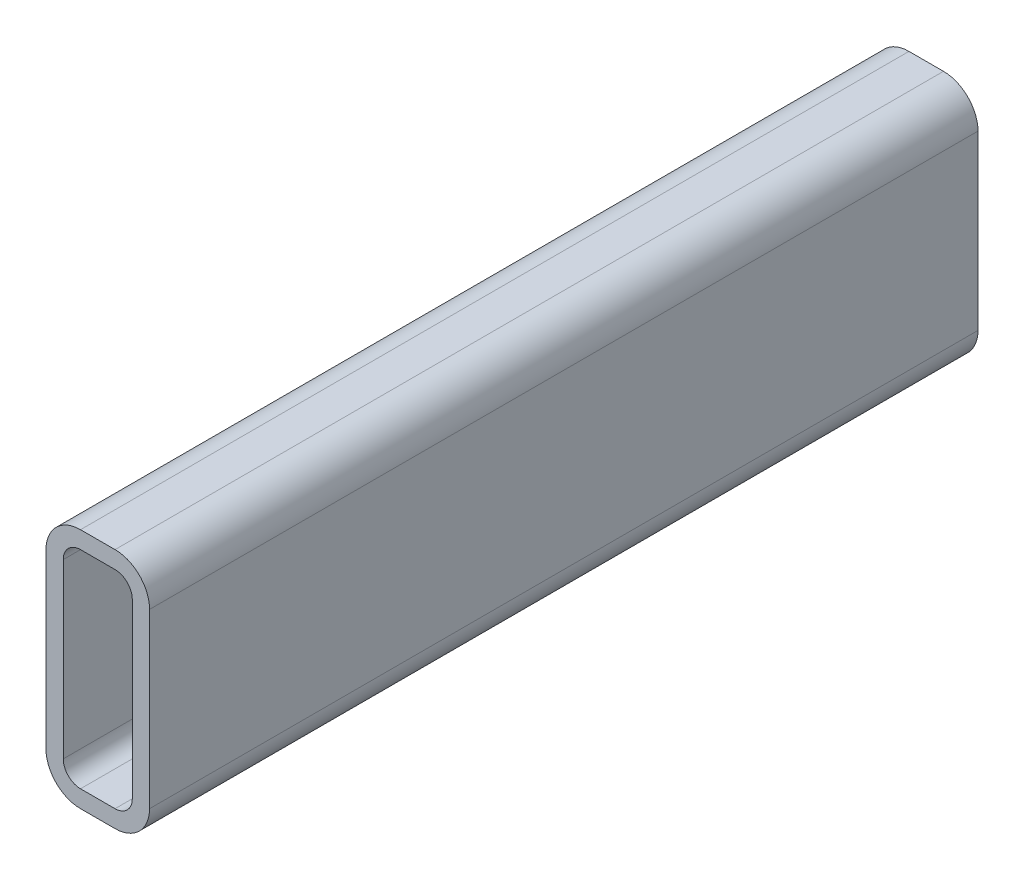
from build123d import *

# Parameters (mm, degrees)
BOSS_EXTRUDE1_DEPTH = 304.8


with BuildPart() as part:
    # Sketch1 → Boss-Extrude1 (new body)
    with BuildSketch(Plane.XY):
        with BuildLine():
            Line((12.7, 88.9), (25.4, 88.9))
            ThreePointArc((25.4, 88.9), (34.380256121, 85.180256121), (38.1, 76.2))
            Line((38.1, 76.2), (38.1, 12.7))
            ThreePointArc((38.1, 12.7), (34.380256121, 3.719743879), (25.4, 0))
            Line((25.4, 0), (12.7, 0))
            ThreePointArc((12.7, 0), (3.719743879, 3.719743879), (0, 12.7))
            Line((0, 12.7), (0, 76.2))
            ThreePointArc((0, 76.2), (3.719743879, 85.180256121), (12.7, 88.9))
        make_face()
        with BuildLine():
            Line((12.7, 82.55), (25.4, 82.55))
            ThreePointArc((25.4, 82.55), (29.890128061, 80.690128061), (31.75, 76.2))
            Line((31.75, 76.2), (31.75, 12.7))
            ThreePointArc((31.75, 12.7), (29.890128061, 8.209871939), (25.4, 6.35))
            Line((25.4, 6.35), (12.7, 6.35))
            ThreePointArc((12.7, 6.35), (8.209871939, 8.209871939), (6.35, 12.7))
            Line((6.35, 12.7), (6.35, 76.2))
            ThreePointArc((6.35, 76.2), (8.209871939, 80.690128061), (12.7, 82.55))
        make_face(mode=Mode.SUBTRACT)
    extrude(amount=BOSS_EXTRUDE1_DEPTH)


solid = part.part
